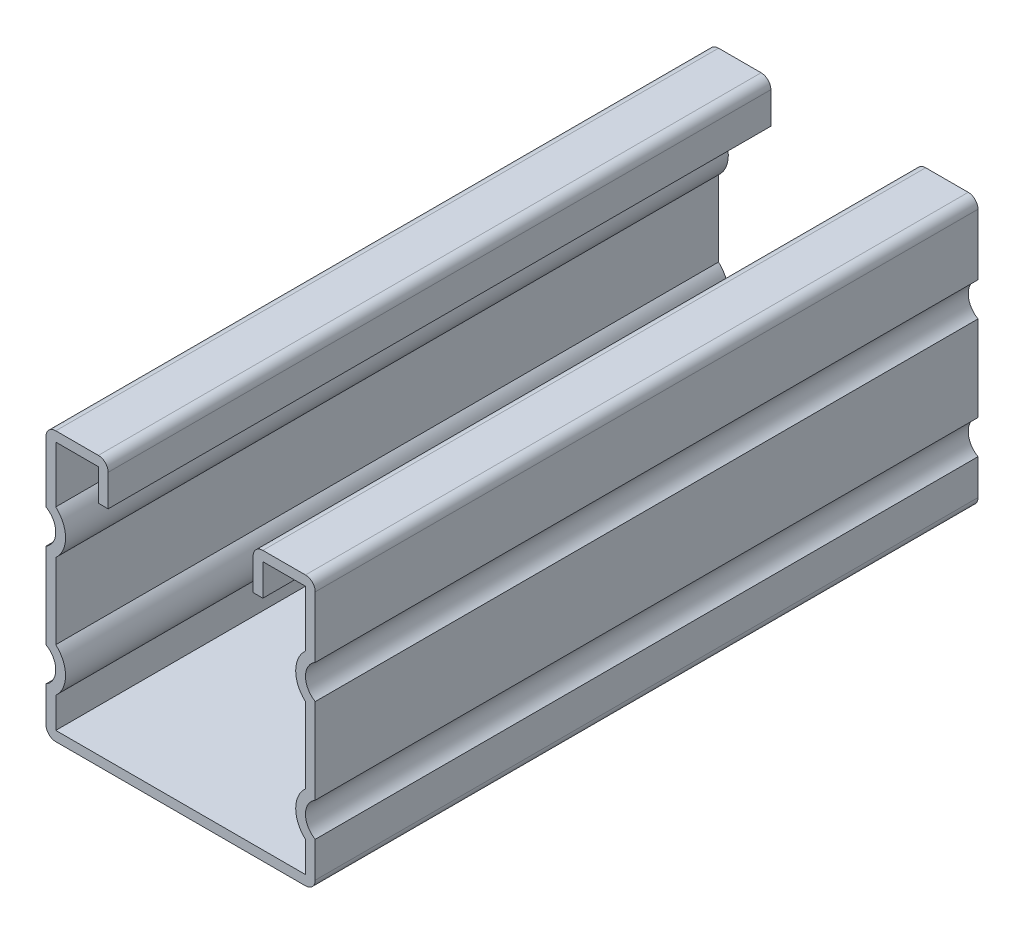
ISO-10303-21;
HEADER;
FILE_DESCRIPTION(('STEP AP214'),'2;1');
FILE_NAME('part.step','',(''),(''),'','','');
FILE_SCHEMA(('AUTOMOTIVE_DESIGN { 1 0 10303 214 1 1 1 1 }'));
ENDSEC;
DATA;
#1=APPLICATION_CONTEXT('core data for automotive mechanical design processes');
#2=APPLICATION_PROTOCOL_DEFINITION('international standard','automotive_design',2000,#1);
#3=PRODUCT_CONTEXT('',#1,'mechanical');
#4=PRODUCT('Part','Part','',(#3));
#5=PRODUCT_RELATED_PRODUCT_CATEGORY('part','',(#4));
#6=PRODUCT_DEFINITION_FORMATION('','',#4);
#7=PRODUCT_DEFINITION_CONTEXT('part definition',#1,'design');
#8=PRODUCT_DEFINITION('design','',#6,#7);
#9=PRODUCT_DEFINITION_SHAPE('','',#8);
#10=(LENGTH_UNIT() NAMED_UNIT(*) SI_UNIT(.MILLI.,.METRE.));
#11=(NAMED_UNIT(*) PLANE_ANGLE_UNIT() SI_UNIT($,.RADIAN.));
#12=(NAMED_UNIT(*) SI_UNIT($,.STERADIAN.) SOLID_ANGLE_UNIT());
#13=UNCERTAINTY_MEASURE_WITH_UNIT(LENGTH_MEASURE(1.E-05),#10,'distance_accuracy_value','');
#14=(GEOMETRIC_REPRESENTATION_CONTEXT(3) GLOBAL_UNCERTAINTY_ASSIGNED_CONTEXT((#13)) GLOBAL_UNIT_ASSIGNED_CONTEXT((#10,
#11,#12)) REPRESENTATION_CONTEXT('',''));
#15=CARTESIAN_POINT('',(0.,0.,0.));
#16=DIRECTION('',(0.,0.,1.));
#17=DIRECTION('',(1.,0.,0.));
#18=AXIS2_PLACEMENT_3D('',#15,#16,#17);
#19=CARTESIAN_POINT('',(-19.1389,21.1074,101.6));
#20=DIRECTION('',(-1.,0.,0.));
#21=DIRECTION('',(0.,-1.,0.));
#22=AXIS2_PLACEMENT_3D('',#19,#20,#21);
#23=PLANE('',#22);
#24=DIRECTION('',(0.,1.,0.));
#25=VECTOR('',#24,1.);
#26=CARTESIAN_POINT('',(-19.1389,21.1074,0.));
#27=LINE('',#26,#25);
#28=CARTESIAN_POINT('',(-19.1389,12.4949714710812,0.));
#29=VERTEX_POINT('',#28);
#30=CARTESIAN_POINT('',(-19.1389,21.1074,0.));
#31=VERTEX_POINT('',#30);
#32=EDGE_CURVE('E310',#29,#31,#27,.T.);
#33=ORIENTED_EDGE('',*,*,#32,.T.);
#34=DIRECTION('',(0.,0.,-1.));
#35=VECTOR('',#34,1.);
#36=CARTESIAN_POINT('',(-19.1389,21.1074,101.6));
#37=LINE('',#36,#35);
#38=CARTESIAN_POINT('',(-19.1389,21.1074,101.6));
#39=VERTEX_POINT('',#38);
#40=EDGE_CURVE('E11',#39,#31,#37,.T.);
#41=ORIENTED_EDGE('',*,*,#40,.F.);
#42=DIRECTION('',(0.,1.,0.));
#43=VECTOR('',#42,1.);
#44=CARTESIAN_POINT('',(-19.1389,21.1074,101.6));
#45=LINE('',#44,#43);
#46=CARTESIAN_POINT('',(-19.1389,12.4949714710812,101.6));
#47=VERTEX_POINT('',#46);
#48=EDGE_CURVE('E384',#47,#39,#45,.T.);
#49=ORIENTED_EDGE('',*,*,#48,.F.);
#50=DIRECTION('',(0.,0.,-1.));
#51=VECTOR('',#50,1.);
#52=CARTESIAN_POINT('',(-19.1389,12.4949714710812,101.6));
#53=LINE('',#52,#51);
#54=EDGE_CURVE('E306',#47,#29,#53,.T.);
#55=ORIENTED_EDGE('',*,*,#54,.T.);
#56=EDGE_LOOP('',(#33,#41,#49,#55));
#57=FACE_BOUND('',#56,.T.);
#58=ADVANCED_FACE('F33',(#57),#23,.F.);
#59=CARTESIAN_POINT('',(-19.1389,21.1074,101.6));
#60=DIRECTION('',(0.,1.,0.));
#61=DIRECTION('',(-1.,0.,0.));
#62=AXIS2_PLACEMENT_3D('',#59,#60,#61);
#63=PLANE('',#62);
#64=DIRECTION('',(1.,0.,0.));
#65=VECTOR('',#64,1.);
#66=CARTESIAN_POINT('',(-19.1389,21.1074,0.));
#67=LINE('',#66,#65);
#68=CARTESIAN_POINT('',(-12.6111,21.1074,0.));
#69=VERTEX_POINT('',#68);
#70=EDGE_CURVE('E313',#31,#69,#67,.T.);
#71=ORIENTED_EDGE('',*,*,#70,.T.);
#72=DIRECTION('',(0.,0.,-1.));
#73=VECTOR('',#72,1.);
#74=CARTESIAN_POINT('',(-12.6111,21.1074,101.6));
#75=LINE('',#74,#73);
#76=CARTESIAN_POINT('',(-12.6111,21.1074,101.6));
#77=VERTEX_POINT('',#76);
#78=EDGE_CURVE('E42',#77,#69,#75,.T.);
#79=ORIENTED_EDGE('',*,*,#78,.F.);
#80=DIRECTION('',(1.,0.,0.));
#81=VECTOR('',#80,1.);
#82=CARTESIAN_POINT('',(-19.1389,21.1074,101.6));
#83=LINE('',#82,#81);
#84=EDGE_CURVE('E183',#39,#77,#83,.T.);
#85=ORIENTED_EDGE('',*,*,#84,.F.);
#86=ORIENTED_EDGE('',*,*,#40,.T.);
#87=EDGE_LOOP('',(#71,#79,#85,#86));
#88=FACE_BOUND('',#87,.T.);
#89=ADVANCED_FACE('F593',(#88),#63,.F.);
#90=CARTESIAN_POINT('',(-12.6111,21.1074,101.6));
#91=DIRECTION('',(1.,0.,0.));
#92=DIRECTION('',(0.,0.,-1.));
#93=AXIS2_PLACEMENT_3D('',#90,#91,#92);
#94=PLANE('',#93);
#95=DIRECTION('',(0.,-1.,0.));
#96=VECTOR('',#95,1.);
#97=CARTESIAN_POINT('',(-12.6111,21.1074,0.));
#98=LINE('',#97,#96);
#99=CARTESIAN_POINT('',(-12.6111,16.256,0.));
#100=VERTEX_POINT('',#99);
#101=EDGE_CURVE('E315',#69,#100,#98,.T.);
#102=ORIENTED_EDGE('',*,*,#101,.T.);
#103=DIRECTION('',(0.,0.,-1.));
#104=VECTOR('',#103,1.);
#105=CARTESIAN_POINT('',(-12.6111,16.256,101.6));
#106=LINE('',#105,#104);
#107=CARTESIAN_POINT('',(-12.6111,16.256,101.6));
#108=VERTEX_POINT('',#107);
#109=EDGE_CURVE('E481',#108,#100,#106,.T.);
#110=ORIENTED_EDGE('',*,*,#109,.F.);
#111=DIRECTION('',(0.,-1.,0.));
#112=VECTOR('',#111,1.);
#113=CARTESIAN_POINT('',(-12.6111,21.1074,101.6));
#114=LINE('',#113,#112);
#115=EDGE_CURVE('E490',#77,#108,#114,.T.);
#116=ORIENTED_EDGE('',*,*,#115,.F.);
#117=ORIENTED_EDGE('',*,*,#78,.T.);
#118=EDGE_LOOP('',(#102,#110,#116,#117));
#119=FACE_BOUND('',#118,.T.);
#120=ADVANCED_FACE('F488',(#119),#94,.F.);
#121=CARTESIAN_POINT('',(-12.6111,16.256,101.6));
#122=DIRECTION('',(0.,1.,0.));
#123=DIRECTION('',(0.,0.,1.));
#124=AXIS2_PLACEMENT_3D('',#121,#122,#123);
#125=PLANE('',#124);
#126=DIRECTION('',(1.,0.,0.));
#127=VECTOR('',#126,1.);
#128=CARTESIAN_POINT('',(-12.6111,16.256,0.));
#129=LINE('',#128,#127);
#130=CARTESIAN_POINT('',(-11.1125,16.256,0.));
#131=VERTEX_POINT('',#130);
#132=EDGE_CURVE('E317',#100,#131,#129,.T.);
#133=ORIENTED_EDGE('',*,*,#132,.T.);
#134=DIRECTION('',(0.,0.,-1.));
#135=VECTOR('',#134,1.);
#136=CARTESIAN_POINT('',(-11.1125,16.256,101.6));
#137=LINE('',#136,#135);
#138=CARTESIAN_POINT('',(-11.1125,16.256,101.6));
#139=VERTEX_POINT('',#138);
#140=EDGE_CURVE('E478',#139,#131,#137,.T.);
#141=ORIENTED_EDGE('',*,*,#140,.F.);
#142=DIRECTION('',(1.,0.,0.));
#143=VECTOR('',#142,1.);
#144=CARTESIAN_POINT('',(-12.6111,16.256,101.6));
#145=LINE('',#144,#143);
#146=EDGE_CURVE('E508',#108,#139,#145,.T.);
#147=ORIENTED_EDGE('',*,*,#146,.F.);
#148=ORIENTED_EDGE('',*,*,#109,.T.);
#149=EDGE_LOOP('',(#133,#141,#147,#148));
#150=FACE_BOUND('',#149,.T.);
#151=ADVANCED_FACE('F499',(#150),#125,.F.);
#152=CARTESIAN_POINT('',(-11.1125,21.1074,101.6));
#153=DIRECTION('',(-1.,0.,0.));
#154=DIRECTION('',(0.,-1.,0.));
#155=AXIS2_PLACEMENT_3D('',#152,#153,#154);
#156=PLANE('',#155);
#157=DIRECTION('',(0.,1.,0.));
#158=VECTOR('',#157,1.);
#159=CARTESIAN_POINT('',(-11.1125,21.1074,0.));
#160=LINE('',#159,#158);
#161=CARTESIAN_POINT('',(-11.1125,21.1074,0.));
#162=VERTEX_POINT('',#161);
#163=EDGE_CURVE('E319',#131,#162,#160,.T.);
#164=ORIENTED_EDGE('',*,*,#163,.T.);
#165=DIRECTION('',(0.,0.,-1.));
#166=VECTOR('',#165,1.);
#167=CARTESIAN_POINT('',(-11.1125,21.1074,101.6));
#168=LINE('',#167,#166);
#169=CARTESIAN_POINT('',(-11.1125,21.1074,101.6));
#170=VERTEX_POINT('',#169);
#171=EDGE_CURVE('E475',#170,#162,#168,.T.);
#172=ORIENTED_EDGE('',*,*,#171,.F.);
#173=DIRECTION('',(0.,1.,0.));
#174=VECTOR('',#173,1.);
#175=CARTESIAN_POINT('',(-11.1125,21.1074,101.6));
#176=LINE('',#175,#174);
#177=EDGE_CURVE('E505',#139,#170,#176,.T.);
#178=ORIENTED_EDGE('',*,*,#177,.F.);
#179=ORIENTED_EDGE('',*,*,#140,.T.);
#180=EDGE_LOOP('',(#164,#172,#178,#179));
#181=FACE_BOUND('',#180,.T.);
#182=ADVANCED_FACE('F503',(#181),#156,.F.);
#183=CARTESIAN_POINT('',(-12.6111,21.1074,101.6));
#184=DIRECTION('',(0.,0.,-1.));
#185=DIRECTION('',(-1.,0.,0.));
#186=AXIS2_PLACEMENT_3D('',#183,#184,#185);
#187=CYLINDRICAL_SURFACE('',#186,1.4986);
#188=CARTESIAN_POINT('',(-12.6111,21.1074,0.));
#189=DIRECTION('',(0.,0.,1.));
#190=DIRECTION('',(-1.,0.,0.));
#191=AXIS2_PLACEMENT_3D('',#188,#189,#190);
#192=CIRCLE('',#191,1.4986);
#193=CARTESIAN_POINT('',(-12.6111,22.606,0.));
#194=VERTEX_POINT('',#193);
#195=EDGE_CURVE('E321',#162,#194,#192,.T.);
#196=ORIENTED_EDGE('',*,*,#195,.T.);
#197=DIRECTION('',(0.,0.,-1.));
#198=VECTOR('',#197,1.);
#199=CARTESIAN_POINT('',(-12.6111,22.606,101.6));
#200=LINE('',#199,#198);
#201=CARTESIAN_POINT('',(-12.6111,22.606,101.6));
#202=VERTEX_POINT('',#201);
#203=EDGE_CURVE('E472',#202,#194,#200,.T.);
#204=ORIENTED_EDGE('',*,*,#203,.F.);
#205=CARTESIAN_POINT('',(-12.6111,21.1074,101.6));
#206=DIRECTION('',(0.,0.,1.));
#207=DIRECTION('',(-1.,0.,0.));
#208=AXIS2_PLACEMENT_3D('',#205,#206,#207);
#209=CIRCLE('',#208,1.4986);
#210=EDGE_CURVE('E507',#170,#202,#209,.T.);
#211=ORIENTED_EDGE('',*,*,#210,.F.);
#212=ORIENTED_EDGE('',*,*,#171,.T.);
#213=EDGE_LOOP('',(#196,#204,#211,#212));
#214=FACE_BOUND('',#213,.T.);
#215=ADVANCED_FACE('F606',(#214),#187,.T.);
#216=CARTESIAN_POINT('',(-19.1389,22.606,101.6));
#217=DIRECTION('',(0.,-1.,0.));
#218=DIRECTION('',(1.,0.,0.));
#219=AXIS2_PLACEMENT_3D('',#216,#217,#218);
#220=PLANE('',#219);
#221=DIRECTION('',(-1.,0.,0.));
#222=VECTOR('',#221,1.);
#223=CARTESIAN_POINT('',(-19.1389,22.606,0.));
#224=LINE('',#223,#222);
#225=CARTESIAN_POINT('',(-19.1389,22.606,0.));
#226=VERTEX_POINT('',#225);
#227=EDGE_CURVE('E323',#194,#226,#224,.T.);
#228=ORIENTED_EDGE('',*,*,#227,.T.);
#229=DIRECTION('',(0.,0.,-1.));
#230=VECTOR('',#229,1.);
#231=CARTESIAN_POINT('',(-19.1389,22.606,101.6));
#232=LINE('',#231,#230);
#233=CARTESIAN_POINT('',(-19.1389,22.606,101.6));
#234=VERTEX_POINT('',#233);
#235=EDGE_CURVE('E469',#234,#226,#232,.T.);
#236=ORIENTED_EDGE('',*,*,#235,.F.);
#237=DIRECTION('',(-1.,0.,0.));
#238=VECTOR('',#237,1.);
#239=CARTESIAN_POINT('',(-19.1389,22.606,101.6));
#240=LINE('',#239,#238);
#241=EDGE_CURVE('E510',#202,#234,#240,.T.);
#242=ORIENTED_EDGE('',*,*,#241,.F.);
#243=ORIENTED_EDGE('',*,*,#203,.T.);
#244=EDGE_LOOP('',(#228,#236,#242,#243));
#245=FACE_BOUND('',#244,.T.);
#246=ADVANCED_FACE('F609',(#245),#220,.F.);
#247=CARTESIAN_POINT('',(-19.1389,21.1074,101.6));
#248=DIRECTION('',(0.,0.,-1.));
#249=DIRECTION('',(-1.,0.,0.));
#250=AXIS2_PLACEMENT_3D('',#247,#248,#249);
#251=CYLINDRICAL_SURFACE('',#250,1.49860000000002);
#252=CARTESIAN_POINT('',(-19.1389,21.1074,0.));
#253=DIRECTION('',(0.,0.,1.));
#254=DIRECTION('',(-1.,0.,0.));
#255=AXIS2_PLACEMENT_3D('',#252,#253,#254);
#256=CIRCLE('',#255,1.49860000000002);
#257=CARTESIAN_POINT('',(-20.6375,21.1074,0.));
#258=VERTEX_POINT('',#257);
#259=EDGE_CURVE('E325',#226,#258,#256,.T.);
#260=ORIENTED_EDGE('',*,*,#259,.T.);
#261=DIRECTION('',(0.,0.,-1.));
#262=VECTOR('',#261,1.);
#263=CARTESIAN_POINT('',(-20.6375,21.1074,101.6));
#264=LINE('',#263,#262);
#265=CARTESIAN_POINT('',(-20.6375,21.1074,101.6));
#266=VERTEX_POINT('',#265);
#267=EDGE_CURVE('E466',#266,#258,#264,.T.);
#268=ORIENTED_EDGE('',*,*,#267,.F.);
#269=CARTESIAN_POINT('',(-19.1389,21.1074,101.6));
#270=DIRECTION('',(0.,0.,1.));
#271=DIRECTION('',(-1.,0.,0.));
#272=AXIS2_PLACEMENT_3D('',#269,#270,#271);
#273=CIRCLE('',#272,1.49860000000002);
#274=EDGE_CURVE('E516',#234,#266,#273,.T.);
#275=ORIENTED_EDGE('',*,*,#274,.F.);
#276=ORIENTED_EDGE('',*,*,#235,.T.);
#277=EDGE_LOOP('',(#260,#268,#275,#276));
#278=FACE_BOUND('',#277,.T.);
#279=ADVANCED_FACE('F613',(#278),#251,.T.);
#280=CARTESIAN_POINT('',(-20.6375,21.1074,101.6));
#281=DIRECTION('',(1.,0.,0.));
#282=DIRECTION('',(0.,0.,-1.));
#283=AXIS2_PLACEMENT_3D('',#280,#281,#282);
#284=PLANE('',#283);
#285=DIRECTION('',(0.,-1.,0.));
#286=VECTOR('',#285,1.);
#287=CARTESIAN_POINT('',(-20.6375,21.1074,0.));
#288=LINE('',#287,#286);
#289=CARTESIAN_POINT('',(-20.6375,11.7396513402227,0.));
#290=VERTEX_POINT('',#289);
#291=EDGE_CURVE('E327',#258,#290,#288,.T.);
#292=ORIENTED_EDGE('',*,*,#291,.T.);
#293=DIRECTION('',(0.,0.,-1.));
#294=VECTOR('',#293,1.);
#295=CARTESIAN_POINT('',(-20.6375,11.7396513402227,101.6));
#296=LINE('',#295,#294);
#297=CARTESIAN_POINT('',(-20.6375,11.7396513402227,101.6));
#298=VERTEX_POINT('',#297);
#299=EDGE_CURVE('E463',#298,#290,#296,.T.);
#300=ORIENTED_EDGE('',*,*,#299,.F.);
#301=DIRECTION('',(0.,-1.,0.));
#302=VECTOR('',#301,1.);
#303=CARTESIAN_POINT('',(-20.6375,21.1074,101.6));
#304=LINE('',#303,#302);
#305=EDGE_CURVE('E518',#266,#298,#304,.T.);
#306=ORIENTED_EDGE('',*,*,#305,.F.);
#307=ORIENTED_EDGE('',*,*,#267,.T.);
#308=EDGE_LOOP('',(#292,#300,#306,#307));
#309=FACE_BOUND('',#308,.T.);
#310=ADVANCED_FACE('F617',(#309),#284,.F.);
#311=CARTESIAN_POINT('',(-22.1361,9.144,101.6));
#312=DIRECTION('',(0.,0.,-1.));
#313=DIRECTION('',(-1.,0.,0.));
#314=AXIS2_PLACEMENT_3D('',#311,#312,#313);
#315=CYLINDRICAL_SURFACE('',#314,2.9972);
#316=CARTESIAN_POINT('',(-22.1361,9.144,0.));
#317=DIRECTION('',(0.,0.,-1.));
#318=DIRECTION('',(1.,0.,0.));
#319=AXIS2_PLACEMENT_3D('',#316,#317,#318);
#320=CIRCLE('',#319,2.9972);
#321=CARTESIAN_POINT('',(-20.6375,6.54834865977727,0.));
#322=VERTEX_POINT('',#321);
#323=EDGE_CURVE('E329',#290,#322,#320,.T.);
#324=ORIENTED_EDGE('',*,*,#323,.T.);
#325=DIRECTION('',(0.,0.,-1.));
#326=VECTOR('',#325,1.);
#327=CARTESIAN_POINT('',(-20.6375,6.54834865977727,101.6));
#328=LINE('',#327,#326);
#329=CARTESIAN_POINT('',(-20.6375,6.54834865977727,101.6));
#330=VERTEX_POINT('',#329);
#331=EDGE_CURVE('E460',#330,#322,#328,.T.);
#332=ORIENTED_EDGE('',*,*,#331,.F.);
#333=CARTESIAN_POINT('',(-22.1361,9.144,101.6));
#334=DIRECTION('',(0.,0.,-1.));
#335=DIRECTION('',(1.,0.,0.));
#336=AXIS2_PLACEMENT_3D('',#333,#334,#335);
#337=CIRCLE('',#336,2.9972);
#338=EDGE_CURVE('E520',#298,#330,#337,.T.);
#339=ORIENTED_EDGE('',*,*,#338,.F.);
#340=ORIENTED_EDGE('',*,*,#299,.T.);
#341=EDGE_LOOP('',(#324,#332,#339,#340));
#342=FACE_BOUND('',#341,.T.);
#343=ADVANCED_FACE('F621',(#342),#315,.F.);
#344=CARTESIAN_POINT('',(-20.6375,6.54834865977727,101.6));
#345=DIRECTION('',(1.,0.,0.));
#346=DIRECTION('',(0.,0.,-1.));
#347=AXIS2_PLACEMENT_3D('',#344,#345,#346);
#348=PLANE('',#347);
#349=DIRECTION('',(0.,-1.,0.));
#350=VECTOR('',#349,1.);
#351=CARTESIAN_POINT('',(-20.6375,6.54834865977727,0.));
#352=LINE('',#351,#350);
#353=CARTESIAN_POINT('',(-20.6375,-6.54834865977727,0.));
#354=VERTEX_POINT('',#353);
#355=EDGE_CURVE('E331',#322,#354,#352,.T.);
#356=ORIENTED_EDGE('',*,*,#355,.T.);
#357=DIRECTION('',(0.,0.,-1.));
#358=VECTOR('',#357,1.);
#359=CARTESIAN_POINT('',(-20.6375,-6.54834865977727,101.6));
#360=LINE('',#359,#358);
#361=CARTESIAN_POINT('',(-20.6375,-6.54834865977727,101.6));
#362=VERTEX_POINT('',#361);
#363=EDGE_CURVE('E457',#362,#354,#360,.T.);
#364=ORIENTED_EDGE('',*,*,#363,.F.);
#365=DIRECTION('',(0.,-1.,0.));
#366=VECTOR('',#365,1.);
#367=CARTESIAN_POINT('',(-20.6375,6.54834865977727,101.6));
#368=LINE('',#367,#366);
#369=EDGE_CURVE('E522',#330,#362,#368,.T.);
#370=ORIENTED_EDGE('',*,*,#369,.F.);
#371=ORIENTED_EDGE('',*,*,#331,.T.);
#372=EDGE_LOOP('',(#356,#364,#370,#371));
#373=FACE_BOUND('',#372,.T.);
#374=ADVANCED_FACE('F625',(#373),#348,.F.);
#375=CARTESIAN_POINT('',(-22.1361,-9.144,101.6));
#376=DIRECTION('',(0.,0.,-1.));
#377=DIRECTION('',(-1.,0.,0.));
#378=AXIS2_PLACEMENT_3D('',#375,#376,#377);
#379=CYLINDRICAL_SURFACE('',#378,2.9972);
#380=CARTESIAN_POINT('',(-22.1361,-9.144,0.));
#381=DIRECTION('',(0.,0.,-1.));
#382=DIRECTION('',(-1.,0.,0.));
#383=AXIS2_PLACEMENT_3D('',#380,#381,#382);
#384=CIRCLE('',#383,2.9972);
#385=CARTESIAN_POINT('',(-20.6375,-11.7396513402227,0.));
#386=VERTEX_POINT('',#385);
#387=EDGE_CURVE('E333',#354,#386,#384,.T.);
#388=ORIENTED_EDGE('',*,*,#387,.T.);
#389=DIRECTION('',(0.,0.,-1.));
#390=VECTOR('',#389,1.);
#391=CARTESIAN_POINT('',(-20.6375,-11.7396513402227,101.6));
#392=LINE('',#391,#390);
#393=CARTESIAN_POINT('',(-20.6375,-11.7396513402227,101.6));
#394=VERTEX_POINT('',#393);
#395=EDGE_CURVE('E454',#394,#386,#392,.T.);
#396=ORIENTED_EDGE('',*,*,#395,.F.);
#397=CARTESIAN_POINT('',(-22.1361,-9.144,101.6));
#398=DIRECTION('',(0.,0.,-1.));
#399=DIRECTION('',(-1.,0.,0.));
#400=AXIS2_PLACEMENT_3D('',#397,#398,#399);
#401=CIRCLE('',#400,2.9972);
#402=EDGE_CURVE('E524',#362,#394,#401,.T.);
#403=ORIENTED_EDGE('',*,*,#402,.F.);
#404=ORIENTED_EDGE('',*,*,#363,.T.);
#405=EDGE_LOOP('',(#388,#396,#403,#404));
#406=FACE_BOUND('',#405,.T.);
#407=ADVANCED_FACE('F629',(#406),#379,.F.);
#408=CARTESIAN_POINT('',(-20.6375,-11.7396513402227,101.6));
#409=DIRECTION('',(1.,0.,0.));
#410=DIRECTION('',(0.,1.,0.));
#411=AXIS2_PLACEMENT_3D('',#408,#409,#410);
#412=PLANE('',#411);
#413=DIRECTION('',(0.,-1.,0.));
#414=VECTOR('',#413,1.);
#415=CARTESIAN_POINT('',(-20.6375,-11.7396513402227,0.));
#416=LINE('',#415,#414);
#417=CARTESIAN_POINT('',(-20.6375,-17.1704,0.));
#418=VERTEX_POINT('',#417);
#419=EDGE_CURVE('E335',#386,#418,#416,.T.);
#420=ORIENTED_EDGE('',*,*,#419,.T.);
#421=DIRECTION('',(0.,0.,-1.));
#422=VECTOR('',#421,1.);
#423=CARTESIAN_POINT('',(-20.6375,-17.1704,101.6));
#424=LINE('',#423,#422);
#425=CARTESIAN_POINT('',(-20.6375,-17.1704,101.6));
#426=VERTEX_POINT('',#425);
#427=EDGE_CURVE('E451',#426,#418,#424,.T.);
#428=ORIENTED_EDGE('',*,*,#427,.F.);
#429=DIRECTION('',(0.,-1.,0.));
#430=VECTOR('',#429,1.);
#431=CARTESIAN_POINT('',(-20.6375,-11.7396513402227,101.6));
#432=LINE('',#431,#430);
#433=EDGE_CURVE('E526',#394,#426,#432,.T.);
#434=ORIENTED_EDGE('',*,*,#433,.F.);
#435=ORIENTED_EDGE('',*,*,#395,.T.);
#436=EDGE_LOOP('',(#420,#428,#434,#435));
#437=FACE_BOUND('',#436,.T.);
#438=ADVANCED_FACE('F633',(#437),#412,.F.);
#439=CARTESIAN_POINT('',(-19.1389,-17.1704,101.6));
#440=DIRECTION('',(0.,0.,-1.));
#441=DIRECTION('',(-1.,0.,0.));
#442=AXIS2_PLACEMENT_3D('',#439,#440,#441);
#443=CYLINDRICAL_SURFACE('',#442,1.4986);
#444=CARTESIAN_POINT('',(-19.1389,-17.1704,0.));
#445=DIRECTION('',(0.,0.,1.));
#446=DIRECTION('',(-1.,0.,0.));
#447=AXIS2_PLACEMENT_3D('',#444,#445,#446);
#448=CIRCLE('',#447,1.4986);
#449=CARTESIAN_POINT('',(-19.1389,-18.669,0.));
#450=VERTEX_POINT('',#449);
#451=EDGE_CURVE('E337',#418,#450,#448,.T.);
#452=ORIENTED_EDGE('',*,*,#451,.T.);
#453=DIRECTION('',(0.,0.,-1.));
#454=VECTOR('',#453,1.);
#455=CARTESIAN_POINT('',(-19.1389,-18.669,101.6));
#456=LINE('',#455,#454);
#457=CARTESIAN_POINT('',(-19.1389,-18.669,101.6));
#458=VERTEX_POINT('',#457);
#459=EDGE_CURVE('E448',#458,#450,#456,.T.);
#460=ORIENTED_EDGE('',*,*,#459,.F.);
#461=CARTESIAN_POINT('',(-19.1389,-17.1704,101.6));
#462=DIRECTION('',(0.,0.,1.));
#463=DIRECTION('',(-1.,0.,0.));
#464=AXIS2_PLACEMENT_3D('',#461,#462,#463);
#465=CIRCLE('',#464,1.4986);
#466=EDGE_CURVE('E528',#426,#458,#465,.T.);
#467=ORIENTED_EDGE('',*,*,#466,.F.);
#468=ORIENTED_EDGE('',*,*,#427,.T.);
#469=EDGE_LOOP('',(#452,#460,#467,#468));
#470=FACE_BOUND('',#469,.T.);
#471=ADVANCED_FACE('F637',(#470),#443,.T.);
#472=CARTESIAN_POINT('',(-19.1389,-18.669,101.6));
#473=DIRECTION('',(0.,1.,0.));
#474=DIRECTION('',(0.,0.,1.));
#475=AXIS2_PLACEMENT_3D('',#472,#473,#474);
#476=PLANE('',#475);
#477=CARTESIAN_POINT('',(0.,-18.669,71.4375));
#478=DIRECTION('',(0.,-1.,0.));
#479=DIRECTION('',(0.,0.,-1.));
#480=AXIS2_PLACEMENT_3D('',#477,#478,#479);
#481=CIRCLE('',#480,7.14375);
#482=CARTESIAN_POINT('',(0.,-18.669,64.29375));
#483=VERTEX_POINT('',#482);
#484=EDGE_CURVE('E792',#483,#483,#481,.T.);
#485=ORIENTED_EDGE('',*,*,#484,.F.);
#486=EDGE_LOOP('',(#485));
#487=FACE_BOUND('',#486,.T.);
#488=CARTESIAN_POINT('',(0.,-18.669,23.8125));
#489=DIRECTION('',(0.,-1.,0.));
#490=DIRECTION('',(0.,0.,-1.));
#491=AXIS2_PLACEMENT_3D('',#488,#489,#490);
#492=CIRCLE('',#491,7.14375);
#493=CARTESIAN_POINT('',(0.,-18.669,16.66875));
#494=VERTEX_POINT('',#493);
#495=EDGE_CURVE('E796',#494,#494,#492,.T.);
#496=ORIENTED_EDGE('',*,*,#495,.F.);
#497=EDGE_LOOP('',(#496));
#498=FACE_BOUND('',#497,.T.);
#499=DIRECTION('',(1.,0.,0.));
#500=VECTOR('',#499,1.);
#501=CARTESIAN_POINT('',(-19.1389,-18.669,0.));
#502=LINE('',#501,#500);
#503=CARTESIAN_POINT('',(19.1389,-18.669,0.));
#504=VERTEX_POINT('',#503);
#505=EDGE_CURVE('E339',#450,#504,#502,.T.);
#506=ORIENTED_EDGE('',*,*,#505,.T.);
#507=DIRECTION('',(0.,0.,-1.));
#508=VECTOR('',#507,1.);
#509=CARTESIAN_POINT('',(19.1389,-18.669,101.6));
#510=LINE('',#509,#508);
#511=CARTESIAN_POINT('',(19.1389,-18.669,101.6));
#512=VERTEX_POINT('',#511);
#513=EDGE_CURVE('E445',#512,#504,#510,.T.);
#514=ORIENTED_EDGE('',*,*,#513,.F.);
#515=DIRECTION('',(1.,0.,0.));
#516=VECTOR('',#515,1.);
#517=CARTESIAN_POINT('',(-19.1389,-18.669,101.6));
#518=LINE('',#517,#516);
#519=EDGE_CURVE('E530',#458,#512,#518,.T.);
#520=ORIENTED_EDGE('',*,*,#519,.F.);
#521=ORIENTED_EDGE('',*,*,#459,.T.);
#522=EDGE_LOOP('',(#506,#514,#520,#521));
#523=FACE_BOUND('',#522,.T.);
#524=ADVANCED_FACE('F641',(#487,#498,#523),#476,.F.);
#525=CARTESIAN_POINT('',(19.1389,-17.1704,101.6));
#526=DIRECTION('',(0.,0.,-1.));
#527=DIRECTION('',(-1.,0.,0.));
#528=AXIS2_PLACEMENT_3D('',#525,#526,#527);
#529=CYLINDRICAL_SURFACE('',#528,1.4986);
#530=CARTESIAN_POINT('',(19.1389,-17.1704,0.));
#531=DIRECTION('',(0.,0.,1.));
#532=DIRECTION('',(-1.,0.,0.));
#533=AXIS2_PLACEMENT_3D('',#530,#531,#532);
#534=CIRCLE('',#533,1.4986);
#535=CARTESIAN_POINT('',(20.6375,-17.1704,0.));
#536=VERTEX_POINT('',#535);
#537=EDGE_CURVE('E341',#504,#536,#534,.T.);
#538=ORIENTED_EDGE('',*,*,#537,.T.);
#539=DIRECTION('',(0.,0.,-1.));
#540=VECTOR('',#539,1.);
#541=CARTESIAN_POINT('',(20.6375,-17.1704,101.6));
#542=LINE('',#541,#540);
#543=CARTESIAN_POINT('',(20.6375,-17.1704,101.6));
#544=VERTEX_POINT('',#543);
#545=EDGE_CURVE('E442',#544,#536,#542,.T.);
#546=ORIENTED_EDGE('',*,*,#545,.F.);
#547=CARTESIAN_POINT('',(19.1389,-17.1704,101.6));
#548=DIRECTION('',(0.,0.,1.));
#549=DIRECTION('',(-1.,0.,0.));
#550=AXIS2_PLACEMENT_3D('',#547,#548,#549);
#551=CIRCLE('',#550,1.4986);
#552=EDGE_CURVE('E532',#512,#544,#551,.T.);
#553=ORIENTED_EDGE('',*,*,#552,.F.);
#554=ORIENTED_EDGE('',*,*,#513,.T.);
#555=EDGE_LOOP('',(#538,#546,#553,#554));
#556=FACE_BOUND('',#555,.T.);
#557=ADVANCED_FACE('F645',(#556),#529,.T.);
#558=CARTESIAN_POINT('',(20.6375,-17.1704,101.6));
#559=DIRECTION('',(-1.,0.,0.));
#560=DIRECTION('',(0.,-1.,0.));
#561=AXIS2_PLACEMENT_3D('',#558,#559,#560);
#562=PLANE('',#561);
#563=DIRECTION('',(0.,1.,0.));
#564=VECTOR('',#563,1.);
#565=CARTESIAN_POINT('',(20.6375,-17.1704,0.));
#566=LINE('',#565,#564);
#567=CARTESIAN_POINT('',(20.6375,-11.7396513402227,0.));
#568=VERTEX_POINT('',#567);
#569=EDGE_CURVE('E343',#536,#568,#566,.T.);
#570=ORIENTED_EDGE('',*,*,#569,.T.);
#571=DIRECTION('',(0.,0.,-1.));
#572=VECTOR('',#571,1.);
#573=CARTESIAN_POINT('',(20.6375,-11.7396513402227,101.6));
#574=LINE('',#573,#572);
#575=CARTESIAN_POINT('',(20.6375,-11.7396513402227,101.6));
#576=VERTEX_POINT('',#575);
#577=EDGE_CURVE('E439',#576,#568,#574,.T.);
#578=ORIENTED_EDGE('',*,*,#577,.F.);
#579=DIRECTION('',(0.,1.,0.));
#580=VECTOR('',#579,1.);
#581=CARTESIAN_POINT('',(20.6375,-17.1704,101.6));
#582=LINE('',#581,#580);
#583=EDGE_CURVE('E534',#544,#576,#582,.T.);
#584=ORIENTED_EDGE('',*,*,#583,.F.);
#585=ORIENTED_EDGE('',*,*,#545,.T.);
#586=EDGE_LOOP('',(#570,#578,#584,#585));
#587=FACE_BOUND('',#586,.T.);
#588=ADVANCED_FACE('F649',(#587),#562,.F.);
#589=CARTESIAN_POINT('',(22.1361,-9.144,101.6));
#590=DIRECTION('',(0.,0.,-1.));
#591=DIRECTION('',(-1.,0.,0.));
#592=AXIS2_PLACEMENT_3D('',#589,#590,#591);
#593=CYLINDRICAL_SURFACE('',#592,2.9972);
#594=CARTESIAN_POINT('',(22.1361,-9.144,0.));
#595=DIRECTION('',(0.,0.,-1.));
#596=DIRECTION('',(-1.,0.,0.));
#597=AXIS2_PLACEMENT_3D('',#594,#595,#596);
#598=CIRCLE('',#597,2.9972);
#599=CARTESIAN_POINT('',(20.6375,-6.54834865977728,0.));
#600=VERTEX_POINT('',#599);
#601=EDGE_CURVE('E345',#568,#600,#598,.T.);
#602=ORIENTED_EDGE('',*,*,#601,.T.);
#603=DIRECTION('',(0.,0.,-1.));
#604=VECTOR('',#603,1.);
#605=CARTESIAN_POINT('',(20.6375,-6.54834865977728,101.6));
#606=LINE('',#605,#604);
#607=CARTESIAN_POINT('',(20.6375,-6.54834865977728,101.6));
#608=VERTEX_POINT('',#607);
#609=EDGE_CURVE('E436',#608,#600,#606,.T.);
#610=ORIENTED_EDGE('',*,*,#609,.F.);
#611=CARTESIAN_POINT('',(22.1361,-9.144,101.6));
#612=DIRECTION('',(0.,0.,-1.));
#613=DIRECTION('',(-1.,0.,0.));
#614=AXIS2_PLACEMENT_3D('',#611,#612,#613);
#615=CIRCLE('',#614,2.9972);
#616=EDGE_CURVE('E536',#576,#608,#615,.T.);
#617=ORIENTED_EDGE('',*,*,#616,.F.);
#618=ORIENTED_EDGE('',*,*,#577,.T.);
#619=EDGE_LOOP('',(#602,#610,#617,#618));
#620=FACE_BOUND('',#619,.T.);
#621=ADVANCED_FACE('F653',(#620),#593,.F.);
#622=CARTESIAN_POINT('',(20.6375,-6.54834865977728,101.6));
#623=DIRECTION('',(-1.,0.,0.));
#624=DIRECTION('',(0.,0.,1.));
#625=AXIS2_PLACEMENT_3D('',#622,#623,#624);
#626=PLANE('',#625);
#627=DIRECTION('',(0.,1.,0.));
#628=VECTOR('',#627,1.);
#629=CARTESIAN_POINT('',(20.6375,-6.54834865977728,0.));
#630=LINE('',#629,#628);
#631=CARTESIAN_POINT('',(20.6375,6.54834865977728,0.));
#632=VERTEX_POINT('',#631);
#633=EDGE_CURVE('E347',#600,#632,#630,.T.);
#634=ORIENTED_EDGE('',*,*,#633,.T.);
#635=DIRECTION('',(0.,0.,-1.));
#636=VECTOR('',#635,1.);
#637=CARTESIAN_POINT('',(20.6375,6.54834865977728,101.6));
#638=LINE('',#637,#636);
#639=CARTESIAN_POINT('',(20.6375,6.54834865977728,101.6));
#640=VERTEX_POINT('',#639);
#641=EDGE_CURVE('E433',#640,#632,#638,.T.);
#642=ORIENTED_EDGE('',*,*,#641,.F.);
#643=DIRECTION('',(0.,1.,0.));
#644=VECTOR('',#643,1.);
#645=CARTESIAN_POINT('',(20.6375,-6.54834865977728,101.6));
#646=LINE('',#645,#644);
#647=EDGE_CURVE('E538',#608,#640,#646,.T.);
#648=ORIENTED_EDGE('',*,*,#647,.F.);
#649=ORIENTED_EDGE('',*,*,#609,.T.);
#650=EDGE_LOOP('',(#634,#642,#648,#649));
#651=FACE_BOUND('',#650,.T.);
#652=ADVANCED_FACE('F657',(#651),#626,.F.);
#653=CARTESIAN_POINT('',(22.1361,9.144,101.6));
#654=DIRECTION('',(0.,0.,-1.));
#655=DIRECTION('',(-1.,0.,0.));
#656=AXIS2_PLACEMENT_3D('',#653,#654,#655);
#657=CYLINDRICAL_SURFACE('',#656,2.9972);
#658=CARTESIAN_POINT('',(22.1361,9.144,0.));
#659=DIRECTION('',(0.,0.,-1.));
#660=DIRECTION('',(1.,0.,0.));
#661=AXIS2_PLACEMENT_3D('',#658,#659,#660);
#662=CIRCLE('',#661,2.9972);
#663=CARTESIAN_POINT('',(20.6375,11.7396513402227,0.));
#664=VERTEX_POINT('',#663);
#665=EDGE_CURVE('E349',#632,#664,#662,.T.);
#666=ORIENTED_EDGE('',*,*,#665,.T.);
#667=DIRECTION('',(0.,0.,-1.));
#668=VECTOR('',#667,1.);
#669=CARTESIAN_POINT('',(20.6375,11.7396513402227,101.6));
#670=LINE('',#669,#668);
#671=CARTESIAN_POINT('',(20.6375,11.7396513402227,101.6));
#672=VERTEX_POINT('',#671);
#673=EDGE_CURVE('E430',#672,#664,#670,.T.);
#674=ORIENTED_EDGE('',*,*,#673,.F.);
#675=CARTESIAN_POINT('',(22.1361,9.144,101.6));
#676=DIRECTION('',(0.,0.,-1.));
#677=DIRECTION('',(1.,0.,0.));
#678=AXIS2_PLACEMENT_3D('',#675,#676,#677);
#679=CIRCLE('',#678,2.9972);
#680=EDGE_CURVE('E540',#640,#672,#679,.T.);
#681=ORIENTED_EDGE('',*,*,#680,.F.);
#682=ORIENTED_EDGE('',*,*,#641,.T.);
#683=EDGE_LOOP('',(#666,#674,#681,#682));
#684=FACE_BOUND('',#683,.T.);
#685=ADVANCED_FACE('F661',(#684),#657,.F.);
#686=CARTESIAN_POINT('',(20.6375,11.7396513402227,101.6));
#687=DIRECTION('',(-1.,0.,0.));
#688=DIRECTION('',(0.,-1.,0.));
#689=AXIS2_PLACEMENT_3D('',#686,#687,#688);
#690=PLANE('',#689);
#691=DIRECTION('',(0.,1.,0.));
#692=VECTOR('',#691,1.);
#693=CARTESIAN_POINT('',(20.6375,11.7396513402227,0.));
#694=LINE('',#693,#692);
#695=CARTESIAN_POINT('',(20.6375,21.1074,0.));
#696=VERTEX_POINT('',#695);
#697=EDGE_CURVE('E351',#664,#696,#694,.T.);
#698=ORIENTED_EDGE('',*,*,#697,.T.);
#699=DIRECTION('',(0.,0.,-1.));
#700=VECTOR('',#699,1.);
#701=CARTESIAN_POINT('',(20.6375,21.1074,101.6));
#702=LINE('',#701,#700);
#703=CARTESIAN_POINT('',(20.6375,21.1074,101.6));
#704=VERTEX_POINT('',#703);
#705=EDGE_CURVE('E427',#704,#696,#702,.T.);
#706=ORIENTED_EDGE('',*,*,#705,.F.);
#707=DIRECTION('',(0.,1.,0.));
#708=VECTOR('',#707,1.);
#709=CARTESIAN_POINT('',(20.6375,11.7396513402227,101.6));
#710=LINE('',#709,#708);
#711=EDGE_CURVE('E542',#672,#704,#710,.T.);
#712=ORIENTED_EDGE('',*,*,#711,.F.);
#713=ORIENTED_EDGE('',*,*,#673,.T.);
#714=EDGE_LOOP('',(#698,#706,#712,#713));
#715=FACE_BOUND('',#714,.T.);
#716=ADVANCED_FACE('F665',(#715),#690,.F.);
#717=CARTESIAN_POINT('',(19.1389,21.1074,101.6));
#718=DIRECTION('',(0.,0.,-1.));
#719=DIRECTION('',(-1.,0.,0.));
#720=AXIS2_PLACEMENT_3D('',#717,#718,#719);
#721=CYLINDRICAL_SURFACE('',#720,1.4986);
#722=CARTESIAN_POINT('',(19.1389,21.1074,0.));
#723=DIRECTION('',(0.,0.,1.));
#724=DIRECTION('',(-1.,0.,0.));
#725=AXIS2_PLACEMENT_3D('',#722,#723,#724);
#726=CIRCLE('',#725,1.4986);
#727=CARTESIAN_POINT('',(19.1389,22.606,0.));
#728=VERTEX_POINT('',#727);
#729=EDGE_CURVE('E353',#696,#728,#726,.T.);
#730=ORIENTED_EDGE('',*,*,#729,.T.);
#731=DIRECTION('',(0.,0.,-1.));
#732=VECTOR('',#731,1.);
#733=CARTESIAN_POINT('',(19.1389,22.606,101.6));
#734=LINE('',#733,#732);
#735=CARTESIAN_POINT('',(19.1389,22.606,101.6));
#736=VERTEX_POINT('',#735);
#737=EDGE_CURVE('E424',#736,#728,#734,.T.);
#738=ORIENTED_EDGE('',*,*,#737,.F.);
#739=CARTESIAN_POINT('',(19.1389,21.1074,101.6));
#740=DIRECTION('',(0.,0.,1.));
#741=DIRECTION('',(-1.,0.,0.));
#742=AXIS2_PLACEMENT_3D('',#739,#740,#741);
#743=CIRCLE('',#742,1.4986);
#744=EDGE_CURVE('E544',#704,#736,#743,.T.);
#745=ORIENTED_EDGE('',*,*,#744,.F.);
#746=ORIENTED_EDGE('',*,*,#705,.T.);
#747=EDGE_LOOP('',(#730,#738,#745,#746));
#748=FACE_BOUND('',#747,.T.);
#749=ADVANCED_FACE('F669',(#748),#721,.T.);
#750=CARTESIAN_POINT('',(19.1389,22.606,101.6));
#751=DIRECTION('',(0.,-1.,0.));
#752=DIRECTION('',(0.,0.,-1.));
#753=AXIS2_PLACEMENT_3D('',#750,#751,#752);
#754=PLANE('',#753);
#755=DIRECTION('',(-1.,0.,0.));
#756=VECTOR('',#755,1.);
#757=CARTESIAN_POINT('',(19.1389,22.606,0.));
#758=LINE('',#757,#756);
#759=CARTESIAN_POINT('',(12.6111,22.606,0.));
#760=VERTEX_POINT('',#759);
#761=EDGE_CURVE('E355',#728,#760,#758,.T.);
#762=ORIENTED_EDGE('',*,*,#761,.T.);
#763=DIRECTION('',(0.,0.,-1.));
#764=VECTOR('',#763,1.);
#765=CARTESIAN_POINT('',(12.6111,22.606,101.6));
#766=LINE('',#765,#764);
#767=CARTESIAN_POINT('',(12.6111,22.606,101.6));
#768=VERTEX_POINT('',#767);
#769=EDGE_CURVE('E421',#768,#760,#766,.T.);
#770=ORIENTED_EDGE('',*,*,#769,.F.);
#771=DIRECTION('',(-1.,0.,0.));
#772=VECTOR('',#771,1.);
#773=CARTESIAN_POINT('',(19.1389,22.606,101.6));
#774=LINE('',#773,#772);
#775=EDGE_CURVE('E546',#736,#768,#774,.T.);
#776=ORIENTED_EDGE('',*,*,#775,.F.);
#777=ORIENTED_EDGE('',*,*,#737,.T.);
#778=EDGE_LOOP('',(#762,#770,#776,#777));
#779=FACE_BOUND('',#778,.T.);
#780=ADVANCED_FACE('F673',(#779),#754,.F.);
#781=CARTESIAN_POINT('',(12.6111,21.1074,101.6));
#782=DIRECTION('',(0.,0.,-1.));
#783=DIRECTION('',(-1.,0.,0.));
#784=AXIS2_PLACEMENT_3D('',#781,#782,#783);
#785=CYLINDRICAL_SURFACE('',#784,1.4986);
#786=CARTESIAN_POINT('',(12.6111,21.1074,0.));
#787=DIRECTION('',(0.,0.,1.));
#788=DIRECTION('',(-1.,0.,0.));
#789=AXIS2_PLACEMENT_3D('',#786,#787,#788);
#790=CIRCLE('',#789,1.4986);
#791=CARTESIAN_POINT('',(11.1125,21.1074,0.));
#792=VERTEX_POINT('',#791);
#793=EDGE_CURVE('E357',#760,#792,#790,.T.);
#794=ORIENTED_EDGE('',*,*,#793,.T.);
#795=DIRECTION('',(0.,0.,-1.));
#796=VECTOR('',#795,1.);
#797=CARTESIAN_POINT('',(11.1125,21.1074,101.6));
#798=LINE('',#797,#796);
#799=CARTESIAN_POINT('',(11.1125,21.1074,101.6));
#800=VERTEX_POINT('',#799);
#801=EDGE_CURVE('E418',#800,#792,#798,.T.);
#802=ORIENTED_EDGE('',*,*,#801,.F.);
#803=CARTESIAN_POINT('',(12.6111,21.1074,101.6));
#804=DIRECTION('',(0.,0.,1.));
#805=DIRECTION('',(-1.,0.,0.));
#806=AXIS2_PLACEMENT_3D('',#803,#804,#805);
#807=CIRCLE('',#806,1.4986);
#808=EDGE_CURVE('E548',#768,#800,#807,.T.);
#809=ORIENTED_EDGE('',*,*,#808,.F.);
#810=ORIENTED_EDGE('',*,*,#769,.T.);
#811=EDGE_LOOP('',(#794,#802,#809,#810));
#812=FACE_BOUND('',#811,.T.);
#813=ADVANCED_FACE('F677',(#812),#785,.T.);
#814=CARTESIAN_POINT('',(11.1125,21.1074,101.6));
#815=DIRECTION('',(1.,0.,0.));
#816=DIRECTION('',(0.,0.,-1.));
#817=AXIS2_PLACEMENT_3D('',#814,#815,#816);
#818=PLANE('',#817);
#819=DIRECTION('',(0.,-1.,0.));
#820=VECTOR('',#819,1.);
#821=CARTESIAN_POINT('',(11.1125,21.1074,0.));
#822=LINE('',#821,#820);
#823=CARTESIAN_POINT('',(11.1125,16.256,0.));
#824=VERTEX_POINT('',#823);
#825=EDGE_CURVE('E359',#792,#824,#822,.T.);
#826=ORIENTED_EDGE('',*,*,#825,.T.);
#827=DIRECTION('',(0.,0.,-1.));
#828=VECTOR('',#827,1.);
#829=CARTESIAN_POINT('',(11.1125,16.256,101.6));
#830=LINE('',#829,#828);
#831=CARTESIAN_POINT('',(11.1125,16.256,101.6));
#832=VERTEX_POINT('',#831);
#833=EDGE_CURVE('E415',#832,#824,#830,.T.);
#834=ORIENTED_EDGE('',*,*,#833,.F.);
#835=DIRECTION('',(0.,-1.,0.));
#836=VECTOR('',#835,1.);
#837=CARTESIAN_POINT('',(11.1125,21.1074,101.6));
#838=LINE('',#837,#836);
#839=EDGE_CURVE('E550',#800,#832,#838,.T.);
#840=ORIENTED_EDGE('',*,*,#839,.F.);
#841=ORIENTED_EDGE('',*,*,#801,.T.);
#842=EDGE_LOOP('',(#826,#834,#840,#841));
#843=FACE_BOUND('',#842,.T.);
#844=ADVANCED_FACE('F681',(#843),#818,.F.);
#845=CARTESIAN_POINT('',(11.1125,16.256,101.6));
#846=DIRECTION('',(0.,1.,0.));
#847=DIRECTION('',(-1.,0.,0.));
#848=AXIS2_PLACEMENT_3D('',#845,#846,#847);
#849=PLANE('',#848);
#850=DIRECTION('',(1.,0.,0.));
#851=VECTOR('',#850,1.);
#852=CARTESIAN_POINT('',(11.1125,16.256,0.));
#853=LINE('',#852,#851);
#854=CARTESIAN_POINT('',(12.6111,16.256,0.));
#855=VERTEX_POINT('',#854);
#856=EDGE_CURVE('E361',#824,#855,#853,.T.);
#857=ORIENTED_EDGE('',*,*,#856,.T.);
#858=DIRECTION('',(0.,0.,-1.));
#859=VECTOR('',#858,1.);
#860=CARTESIAN_POINT('',(12.6111,16.256,101.6));
#861=LINE('',#860,#859);
#862=CARTESIAN_POINT('',(12.6111,16.256,101.6));
#863=VERTEX_POINT('',#862);
#864=EDGE_CURVE('E412',#863,#855,#861,.T.);
#865=ORIENTED_EDGE('',*,*,#864,.F.);
#866=DIRECTION('',(1.,0.,0.));
#867=VECTOR('',#866,1.);
#868=CARTESIAN_POINT('',(11.1125,16.256,101.6));
#869=LINE('',#868,#867);
#870=EDGE_CURVE('E552',#832,#863,#869,.T.);
#871=ORIENTED_EDGE('',*,*,#870,.F.);
#872=ORIENTED_EDGE('',*,*,#833,.T.);
#873=EDGE_LOOP('',(#857,#865,#871,#872));
#874=FACE_BOUND('',#873,.T.);
#875=ADVANCED_FACE('F685',(#874),#849,.F.);
#876=CARTESIAN_POINT('',(12.6111,21.1074,101.6));
#877=DIRECTION('',(-1.,0.,0.));
#878=DIRECTION('',(0.,0.,1.));
#879=AXIS2_PLACEMENT_3D('',#876,#877,#878);
#880=PLANE('',#879);
#881=DIRECTION('',(0.,1.,0.));
#882=VECTOR('',#881,1.);
#883=CARTESIAN_POINT('',(12.6111,21.1074,0.));
#884=LINE('',#883,#882);
#885=CARTESIAN_POINT('',(12.6111,21.1074,0.));
#886=VERTEX_POINT('',#885);
#887=EDGE_CURVE('E363',#855,#886,#884,.T.);
#888=ORIENTED_EDGE('',*,*,#887,.T.);
#889=DIRECTION('',(0.,0.,-1.));
#890=VECTOR('',#889,1.);
#891=CARTESIAN_POINT('',(12.6111,21.1074,101.6));
#892=LINE('',#891,#890);
#893=CARTESIAN_POINT('',(12.6111,21.1074,101.6));
#894=VERTEX_POINT('',#893);
#895=EDGE_CURVE('E409',#894,#886,#892,.T.);
#896=ORIENTED_EDGE('',*,*,#895,.F.);
#897=DIRECTION('',(0.,1.,0.));
#898=VECTOR('',#897,1.);
#899=CARTESIAN_POINT('',(12.6111,21.1074,101.6));
#900=LINE('',#899,#898);
#901=EDGE_CURVE('E554',#863,#894,#900,.T.);
#902=ORIENTED_EDGE('',*,*,#901,.F.);
#903=ORIENTED_EDGE('',*,*,#864,.T.);
#904=EDGE_LOOP('',(#888,#896,#902,#903));
#905=FACE_BOUND('',#904,.T.);
#906=ADVANCED_FACE('F689',(#905),#880,.F.);
#907=CARTESIAN_POINT('',(19.1389,21.1074,101.6));
#908=DIRECTION('',(0.,1.,0.));
#909=DIRECTION('',(0.,0.,1.));
#910=AXIS2_PLACEMENT_3D('',#907,#908,#909);
#911=PLANE('',#910);
#912=DIRECTION('',(1.,0.,0.));
#913=VECTOR('',#912,1.);
#914=CARTESIAN_POINT('',(19.1389,21.1074,0.));
#915=LINE('',#914,#913);
#916=CARTESIAN_POINT('',(19.1389,21.1074,0.));
#917=VERTEX_POINT('',#916);
#918=EDGE_CURVE('E365',#886,#917,#915,.T.);
#919=ORIENTED_EDGE('',*,*,#918,.T.);
#920=DIRECTION('',(0.,0.,-1.));
#921=VECTOR('',#920,1.);
#922=CARTESIAN_POINT('',(19.1389,21.1074,101.6));
#923=LINE('',#922,#921);
#924=CARTESIAN_POINT('',(19.1389,21.1074,101.6));
#925=VERTEX_POINT('',#924);
#926=EDGE_CURVE('E406',#925,#917,#923,.T.);
#927=ORIENTED_EDGE('',*,*,#926,.F.);
#928=DIRECTION('',(1.,0.,0.));
#929=VECTOR('',#928,1.);
#930=CARTESIAN_POINT('',(19.1389,21.1074,101.6));
#931=LINE('',#930,#929);
#932=EDGE_CURVE('E556',#894,#925,#931,.T.);
#933=ORIENTED_EDGE('',*,*,#932,.F.);
#934=ORIENTED_EDGE('',*,*,#895,.T.);
#935=EDGE_LOOP('',(#919,#927,#933,#934));
#936=FACE_BOUND('',#935,.T.);
#937=ADVANCED_FACE('F693',(#936),#911,.F.);
#938=CARTESIAN_POINT('',(19.1389,12.4949714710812,101.6));
#939=DIRECTION('',(1.,0.,0.));
#940=DIRECTION('',(0.,1.,0.));
#941=AXIS2_PLACEMENT_3D('',#938,#939,#940);
#942=PLANE('',#941);
#943=DIRECTION('',(0.,-1.,0.));
#944=VECTOR('',#943,1.);
#945=CARTESIAN_POINT('',(19.1389,12.4949714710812,0.));
#946=LINE('',#945,#944);
#947=CARTESIAN_POINT('',(19.1389,12.4949714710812,0.));
#948=VERTEX_POINT('',#947);
#949=EDGE_CURVE('E367',#917,#948,#946,.T.);
#950=ORIENTED_EDGE('',*,*,#949,.T.);
#951=DIRECTION('',(0.,0.,-1.));
#952=VECTOR('',#951,1.);
#953=CARTESIAN_POINT('',(19.1389,12.4949714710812,101.6));
#954=LINE('',#953,#952);
#955=CARTESIAN_POINT('',(19.1389,12.4949714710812,101.6));
#956=VERTEX_POINT('',#955);
#957=EDGE_CURVE('E403',#956,#948,#954,.T.);
#958=ORIENTED_EDGE('',*,*,#957,.F.);
#959=DIRECTION('',(0.,-1.,0.));
#960=VECTOR('',#959,1.);
#961=CARTESIAN_POINT('',(19.1389,12.4949714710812,101.6));
#962=LINE('',#961,#960);
#963=EDGE_CURVE('E558',#925,#956,#962,.T.);
#964=ORIENTED_EDGE('',*,*,#963,.F.);
#965=ORIENTED_EDGE('',*,*,#926,.T.);
#966=EDGE_LOOP('',(#950,#958,#964,#965));
#967=FACE_BOUND('',#966,.T.);
#968=ADVANCED_FACE('F697',(#967),#942,.F.);
#969=CARTESIAN_POINT('',(22.1361,9.144,101.6));
#970=DIRECTION('',(0.,0.,-1.));
#971=DIRECTION('',(-1.,0.,0.));
#972=AXIS2_PLACEMENT_3D('',#969,#970,#971);
#973=CYLINDRICAL_SURFACE('',#972,4.49580000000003);
#974=CARTESIAN_POINT('',(22.1361,9.144,0.));
#975=DIRECTION('',(0.,0.,1.));
#976=DIRECTION('',(1.,0.,0.));
#977=AXIS2_PLACEMENT_3D('',#974,#975,#976);
#978=CIRCLE('',#977,4.49580000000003);
#979=CARTESIAN_POINT('',(19.1389,5.79302852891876,0.));
#980=VERTEX_POINT('',#979);
#981=EDGE_CURVE('E369',#948,#980,#978,.T.);
#982=ORIENTED_EDGE('',*,*,#981,.T.);
#983=DIRECTION('',(0.,0.,-1.));
#984=VECTOR('',#983,1.);
#985=CARTESIAN_POINT('',(19.1389,5.79302852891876,101.6));
#986=LINE('',#985,#984);
#987=CARTESIAN_POINT('',(19.1389,5.79302852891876,101.6));
#988=VERTEX_POINT('',#987);
#989=EDGE_CURVE('E400',#988,#980,#986,.T.);
#990=ORIENTED_EDGE('',*,*,#989,.F.);
#991=CARTESIAN_POINT('',(22.1361,9.144,101.6));
#992=DIRECTION('',(0.,0.,1.));
#993=DIRECTION('',(1.,0.,0.));
#994=AXIS2_PLACEMENT_3D('',#991,#992,#993);
#995=CIRCLE('',#994,4.49580000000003);
#996=EDGE_CURVE('E560',#956,#988,#995,.T.);
#997=ORIENTED_EDGE('',*,*,#996,.F.);
#998=ORIENTED_EDGE('',*,*,#957,.T.);
#999=EDGE_LOOP('',(#982,#990,#997,#998));
#1000=FACE_BOUND('',#999,.T.);
#1001=ADVANCED_FACE('F701',(#1000),#973,.T.);
#1002=CARTESIAN_POINT('',(19.1389,-5.79302852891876,101.6));
#1003=DIRECTION('',(1.,0.,0.));
#1004=DIRECTION('',(0.,0.,-1.));
#1005=AXIS2_PLACEMENT_3D('',#1002,#1003,#1004);
#1006=PLANE('',#1005);
#1007=DIRECTION('',(0.,-1.,0.));
#1008=VECTOR('',#1007,1.);
#1009=CARTESIAN_POINT('',(19.1389,-5.79302852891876,0.));
#1010=LINE('',#1009,#1008);
#1011=CARTESIAN_POINT('',(19.1389,-5.79302852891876,0.));
#1012=VERTEX_POINT('',#1011);
#1013=EDGE_CURVE('E371',#980,#1012,#1010,.T.);
#1014=ORIENTED_EDGE('',*,*,#1013,.T.);
#1015=DIRECTION('',(0.,0.,-1.));
#1016=VECTOR('',#1015,1.);
#1017=CARTESIAN_POINT('',(19.1389,-5.79302852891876,101.6));
#1018=LINE('',#1017,#1016);
#1019=CARTESIAN_POINT('',(19.1389,-5.79302852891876,101.6));
#1020=VERTEX_POINT('',#1019);
#1021=EDGE_CURVE('E397',#1020,#1012,#1018,.T.);
#1022=ORIENTED_EDGE('',*,*,#1021,.F.);
#1023=DIRECTION('',(0.,-1.,0.));
#1024=VECTOR('',#1023,1.);
#1025=CARTESIAN_POINT('',(19.1389,-5.79302852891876,101.6));
#1026=LINE('',#1025,#1024);
#1027=EDGE_CURVE('E562',#988,#1020,#1026,.T.);
#1028=ORIENTED_EDGE('',*,*,#1027,.F.);
#1029=ORIENTED_EDGE('',*,*,#989,.T.);
#1030=EDGE_LOOP('',(#1014,#1022,#1028,#1029));
#1031=FACE_BOUND('',#1030,.T.);
#1032=ADVANCED_FACE('F705',(#1031),#1006,.F.);
#1033=CARTESIAN_POINT('',(22.1361,-9.144,101.6));
#1034=DIRECTION('',(0.,0.,-1.));
#1035=DIRECTION('',(-1.,0.,0.));
#1036=AXIS2_PLACEMENT_3D('',#1033,#1034,#1035);
#1037=CYLINDRICAL_SURFACE('',#1036,4.49580000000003);
#1038=CARTESIAN_POINT('',(22.1361,-9.144,0.));
#1039=DIRECTION('',(0.,0.,1.));
#1040=DIRECTION('',(-1.,0.,0.));
#1041=AXIS2_PLACEMENT_3D('',#1038,#1039,#1040);
#1042=CIRCLE('',#1041,4.49580000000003);
#1043=CARTESIAN_POINT('',(19.1389,-12.4949714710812,0.));
#1044=VERTEX_POINT('',#1043);
#1045=EDGE_CURVE('E373',#1012,#1044,#1042,.T.);
#1046=ORIENTED_EDGE('',*,*,#1045,.T.);
#1047=DIRECTION('',(0.,0.,-1.));
#1048=VECTOR('',#1047,1.);
#1049=CARTESIAN_POINT('',(19.1389,-12.4949714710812,101.6));
#1050=LINE('',#1049,#1048);
#1051=CARTESIAN_POINT('',(19.1389,-12.4949714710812,101.6));
#1052=VERTEX_POINT('',#1051);
#1053=EDGE_CURVE('E394',#1052,#1044,#1050,.T.);
#1054=ORIENTED_EDGE('',*,*,#1053,.F.);
#1055=CARTESIAN_POINT('',(22.1361,-9.144,101.6));
#1056=DIRECTION('',(0.,0.,1.));
#1057=DIRECTION('',(-1.,0.,0.));
#1058=AXIS2_PLACEMENT_3D('',#1055,#1056,#1057);
#1059=CIRCLE('',#1058,4.49580000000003);
#1060=EDGE_CURVE('E564',#1020,#1052,#1059,.T.);
#1061=ORIENTED_EDGE('',*,*,#1060,.F.);
#1062=ORIENTED_EDGE('',*,*,#1021,.T.);
#1063=EDGE_LOOP('',(#1046,#1054,#1061,#1062));
#1064=FACE_BOUND('',#1063,.T.);
#1065=ADVANCED_FACE('F709',(#1064),#1037,.T.);
#1066=CARTESIAN_POINT('',(19.1389,-17.1704,101.6));
#1067=DIRECTION('',(1.,0.,0.));
#1068=DIRECTION('',(0.,0.,-1.));
#1069=AXIS2_PLACEMENT_3D('',#1066,#1067,#1068);
#1070=PLANE('',#1069);
#1071=DIRECTION('',(0.,-1.,0.));
#1072=VECTOR('',#1071,1.);
#1073=CARTESIAN_POINT('',(19.1389,-17.1704,0.));
#1074=LINE('',#1073,#1072);
#1075=CARTESIAN_POINT('',(19.1389,-17.1704,0.));
#1076=VERTEX_POINT('',#1075);
#1077=EDGE_CURVE('E375',#1044,#1076,#1074,.T.);
#1078=ORIENTED_EDGE('',*,*,#1077,.T.);
#1079=DIRECTION('',(0.,0.,-1.));
#1080=VECTOR('',#1079,1.);
#1081=CARTESIAN_POINT('',(19.1389,-17.1704,101.6));
#1082=LINE('',#1081,#1080);
#1083=CARTESIAN_POINT('',(19.1389,-17.1704,101.6));
#1084=VERTEX_POINT('',#1083);
#1085=EDGE_CURVE('E391',#1084,#1076,#1082,.T.);
#1086=ORIENTED_EDGE('',*,*,#1085,.F.);
#1087=DIRECTION('',(0.,-1.,0.));
#1088=VECTOR('',#1087,1.);
#1089=CARTESIAN_POINT('',(19.1389,-17.1704,101.6));
#1090=LINE('',#1089,#1088);
#1091=EDGE_CURVE('E566',#1052,#1084,#1090,.T.);
#1092=ORIENTED_EDGE('',*,*,#1091,.F.);
#1093=ORIENTED_EDGE('',*,*,#1053,.T.);
#1094=EDGE_LOOP('',(#1078,#1086,#1092,#1093));
#1095=FACE_BOUND('',#1094,.T.);
#1096=ADVANCED_FACE('F713',(#1095),#1070,.F.);
#1097=CARTESIAN_POINT('',(-19.1389,-17.1704,101.6));
#1098=DIRECTION('',(0.,-1.,0.));
#1099=DIRECTION('',(0.,0.,-1.));
#1100=AXIS2_PLACEMENT_3D('',#1097,#1098,#1099);
#1101=PLANE('',#1100);
#1102=CARTESIAN_POINT('',(0.,-17.1704,71.4375));
#1103=DIRECTION('',(0.,-1.,0.));
#1104=DIRECTION('',(0.,0.,-1.));
#1105=AXIS2_PLACEMENT_3D('',#1102,#1103,#1104);
#1106=CIRCLE('',#1105,7.14375);
#1107=CARTESIAN_POINT('',(0.,-17.1704,64.29375));
#1108=VERTEX_POINT('',#1107);
#1109=EDGE_CURVE('E795',#1108,#1108,#1106,.T.);
#1110=ORIENTED_EDGE('',*,*,#1109,.T.);
#1111=EDGE_LOOP('',(#1110));
#1112=FACE_BOUND('',#1111,.T.);
#1113=CARTESIAN_POINT('',(0.,-17.1704,23.8125));
#1114=DIRECTION('',(0.,-1.,0.));
#1115=DIRECTION('',(0.,0.,-1.));
#1116=AXIS2_PLACEMENT_3D('',#1113,#1114,#1115);
#1117=CIRCLE('',#1116,7.14375);
#1118=CARTESIAN_POINT('',(0.,-17.1704,16.66875));
#1119=VERTEX_POINT('',#1118);
#1120=EDGE_CURVE('E36',#1119,#1119,#1117,.T.);
#1121=ORIENTED_EDGE('',*,*,#1120,.T.);
#1122=EDGE_LOOP('',(#1121));
#1123=FACE_BOUND('',#1122,.T.);
#1124=DIRECTION('',(-1.,0.,0.));
#1125=VECTOR('',#1124,1.);
#1126=CARTESIAN_POINT('',(-19.1389,-17.1704,0.));
#1127=LINE('',#1126,#1125);
#1128=CARTESIAN_POINT('',(-19.1389,-17.1704,0.));
#1129=VERTEX_POINT('',#1128);
#1130=EDGE_CURVE('E377',#1076,#1129,#1127,.T.);
#1131=ORIENTED_EDGE('',*,*,#1130,.T.);
#1132=DIRECTION('',(0.,0.,-1.));
#1133=VECTOR('',#1132,1.);
#1134=CARTESIAN_POINT('',(-19.1389,-17.1704,101.6));
#1135=LINE('',#1134,#1133);
#1136=CARTESIAN_POINT('',(-19.1389,-17.1704,101.6));
#1137=VERTEX_POINT('',#1136);
#1138=EDGE_CURVE('E388',#1137,#1129,#1135,.T.);
#1139=ORIENTED_EDGE('',*,*,#1138,.F.);
#1140=DIRECTION('',(-1.,0.,0.));
#1141=VECTOR('',#1140,1.);
#1142=CARTESIAN_POINT('',(-19.1389,-17.1704,101.6));
#1143=LINE('',#1142,#1141);
#1144=EDGE_CURVE('E568',#1084,#1137,#1143,.T.);
#1145=ORIENTED_EDGE('',*,*,#1144,.F.);
#1146=ORIENTED_EDGE('',*,*,#1085,.T.);
#1147=EDGE_LOOP('',(#1131,#1139,#1145,#1146));
#1148=FACE_BOUND('',#1147,.T.);
#1149=ADVANCED_FACE('F574',(#1112,#1123,#1148),#1101,.F.);
#1150=CARTESIAN_POINT('',(-19.1389,-12.4949714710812,101.6));
#1151=DIRECTION('',(-1.,0.,0.));
#1152=DIRECTION('',(0.,0.,1.));
#1153=AXIS2_PLACEMENT_3D('',#1150,#1151,#1152);
#1154=PLANE('',#1153);
#1155=DIRECTION('',(0.,1.,0.));
#1156=VECTOR('',#1155,1.);
#1157=CARTESIAN_POINT('',(-19.1389,-12.4949714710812,0.));
#1158=LINE('',#1157,#1156);
#1159=CARTESIAN_POINT('',(-19.1389,-12.4949714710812,0.));
#1160=VERTEX_POINT('',#1159);
#1161=EDGE_CURVE('E379',#1129,#1160,#1158,.T.);
#1162=ORIENTED_EDGE('',*,*,#1161,.T.);
#1163=DIRECTION('',(0.,0.,-1.));
#1164=VECTOR('',#1163,1.);
#1165=CARTESIAN_POINT('',(-19.1389,-12.4949714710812,101.6));
#1166=LINE('',#1165,#1164);
#1167=CARTESIAN_POINT('',(-19.1389,-12.4949714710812,101.6));
#1168=VERTEX_POINT('',#1167);
#1169=EDGE_CURVE('E301',#1168,#1160,#1166,.T.);
#1170=ORIENTED_EDGE('',*,*,#1169,.F.);
#1171=DIRECTION('',(0.,1.,0.));
#1172=VECTOR('',#1171,1.);
#1173=CARTESIAN_POINT('',(-19.1389,-12.4949714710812,101.6));
#1174=LINE('',#1173,#1172);
#1175=EDGE_CURVE('E292',#1137,#1168,#1174,.T.);
#1176=ORIENTED_EDGE('',*,*,#1175,.F.);
#1177=ORIENTED_EDGE('',*,*,#1138,.T.);
#1178=EDGE_LOOP('',(#1162,#1170,#1176,#1177));
#1179=FACE_BOUND('',#1178,.T.);
#1180=ADVANCED_FACE('F578',(#1179),#1154,.F.);
#1181=CARTESIAN_POINT('',(-22.1361,-9.144,101.6));
#1182=DIRECTION('',(0.,0.,-1.));
#1183=DIRECTION('',(-1.,0.,0.));
#1184=AXIS2_PLACEMENT_3D('',#1181,#1182,#1183);
#1185=CYLINDRICAL_SURFACE('',#1184,4.49580000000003);
#1186=CARTESIAN_POINT('',(-22.1361,-9.144,0.));
#1187=DIRECTION('',(0.,0.,1.));
#1188=DIRECTION('',(-1.,0.,0.));
#1189=AXIS2_PLACEMENT_3D('',#1186,#1187,#1188);
#1190=CIRCLE('',#1189,4.49580000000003);
#1191=CARTESIAN_POINT('',(-19.1389,-5.79302852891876,0.));
#1192=VERTEX_POINT('',#1191);
#1193=EDGE_CURVE('E300',#1160,#1192,#1190,.T.);
#1194=ORIENTED_EDGE('',*,*,#1193,.T.);
#1195=DIRECTION('',(0.,0.,-1.));
#1196=VECTOR('',#1195,1.);
#1197=CARTESIAN_POINT('',(-19.1389,-5.79302852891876,101.6));
#1198=LINE('',#1197,#1196);
#1199=CARTESIAN_POINT('',(-19.1389,-5.79302852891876,101.6));
#1200=VERTEX_POINT('',#1199);
#1201=EDGE_CURVE('E297',#1200,#1192,#1198,.T.);
#1202=ORIENTED_EDGE('',*,*,#1201,.F.);
#1203=CARTESIAN_POINT('',(-22.1361,-9.144,101.6));
#1204=DIRECTION('',(0.,0.,1.));
#1205=DIRECTION('',(-1.,0.,0.));
#1206=AXIS2_PLACEMENT_3D('',#1203,#1204,#1205);
#1207=CIRCLE('',#1206,4.49580000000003);
#1208=EDGE_CURVE('E286',#1168,#1200,#1207,.T.);
#1209=ORIENTED_EDGE('',*,*,#1208,.F.);
#1210=ORIENTED_EDGE('',*,*,#1169,.T.);
#1211=EDGE_LOOP('',(#1194,#1202,#1209,#1210));
#1212=FACE_BOUND('',#1211,.T.);
#1213=ADVANCED_FACE('F298',(#1212),#1185,.T.);
#1214=CARTESIAN_POINT('',(-19.1389,5.79302852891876,101.6));
#1215=DIRECTION('',(-1.,0.,0.));
#1216=DIRECTION('',(0.,0.,1.));
#1217=AXIS2_PLACEMENT_3D('',#1214,#1215,#1216);
#1218=PLANE('',#1217);
#1219=DIRECTION('',(0.,1.,0.));
#1220=VECTOR('',#1219,1.);
#1221=CARTESIAN_POINT('',(-19.1389,5.79302852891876,0.));
#1222=LINE('',#1221,#1220);
#1223=CARTESIAN_POINT('',(-19.1389,5.79302852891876,0.));
#1224=VERTEX_POINT('',#1223);
#1225=EDGE_CURVE('E169',#1192,#1224,#1222,.T.);
#1226=ORIENTED_EDGE('',*,*,#1225,.T.);
#1227=DIRECTION('',(0.,0.,-1.));
#1228=VECTOR('',#1227,1.);
#1229=CARTESIAN_POINT('',(-19.1389,5.79302852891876,101.6));
#1230=LINE('',#1229,#1228);
#1231=CARTESIAN_POINT('',(-19.1389,5.79302852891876,101.6));
#1232=VERTEX_POINT('',#1231);
#1233=EDGE_CURVE('E302',#1232,#1224,#1230,.T.);
#1234=ORIENTED_EDGE('',*,*,#1233,.F.);
#1235=DIRECTION('',(0.,1.,0.));
#1236=VECTOR('',#1235,1.);
#1237=CARTESIAN_POINT('',(-19.1389,5.79302852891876,101.6));
#1238=LINE('',#1237,#1236);
#1239=EDGE_CURVE('E290',#1200,#1232,#1238,.T.);
#1240=ORIENTED_EDGE('',*,*,#1239,.F.);
#1241=ORIENTED_EDGE('',*,*,#1201,.T.);
#1242=EDGE_LOOP('',(#1226,#1234,#1240,#1241));
#1243=FACE_BOUND('',#1242,.T.);
#1244=ADVANCED_FACE('F304',(#1243),#1218,.F.);
#1245=CARTESIAN_POINT('',(-22.1361,9.144,101.6));
#1246=DIRECTION('',(0.,0.,-1.));
#1247=DIRECTION('',(-1.,0.,0.));
#1248=AXIS2_PLACEMENT_3D('',#1245,#1246,#1247);
#1249=CYLINDRICAL_SURFACE('',#1248,4.49580000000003);
#1250=CARTESIAN_POINT('',(-22.1361,9.144,0.));
#1251=DIRECTION('',(0.,0.,1.));
#1252=DIRECTION('',(1.,0.,0.));
#1253=AXIS2_PLACEMENT_3D('',#1250,#1251,#1252);
#1254=CIRCLE('',#1253,4.49580000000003);
#1255=EDGE_CURVE('E175',#1224,#29,#1254,.T.);
#1256=ORIENTED_EDGE('',*,*,#1255,.T.);
#1257=ORIENTED_EDGE('',*,*,#54,.F.);
#1258=CARTESIAN_POINT('',(-22.1361,9.144,101.6));
#1259=DIRECTION('',(0.,0.,1.));
#1260=DIRECTION('',(1.,0.,0.));
#1261=AXIS2_PLACEMENT_3D('',#1258,#1259,#1260);
#1262=CIRCLE('',#1261,4.49580000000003);
#1263=EDGE_CURVE('E50',#1232,#47,#1262,.T.);
#1264=ORIENTED_EDGE('',*,*,#1263,.F.);
#1265=ORIENTED_EDGE('',*,*,#1233,.T.);
#1266=EDGE_LOOP('',(#1256,#1257,#1264,#1265));
#1267=FACE_BOUND('',#1266,.T.);
#1268=ADVANCED_FACE('F582',(#1267),#1249,.T.);
#1269=CARTESIAN_POINT('',(-22.1361,9.144,101.6));
#1270=DIRECTION('',(0.,0.,1.));
#1271=DIRECTION('',(1.,0.,0.));
#1272=AXIS2_PLACEMENT_3D('',#1269,#1270,#1271);
#1273=PLANE('',#1272);
#1274=ORIENTED_EDGE('',*,*,#48,.T.);
#1275=ORIENTED_EDGE('',*,*,#84,.T.);
#1276=ORIENTED_EDGE('',*,*,#115,.T.);
#1277=ORIENTED_EDGE('',*,*,#146,.T.);
#1278=ORIENTED_EDGE('',*,*,#177,.T.);
#1279=ORIENTED_EDGE('',*,*,#210,.T.);
#1280=ORIENTED_EDGE('',*,*,#241,.T.);
#1281=ORIENTED_EDGE('',*,*,#274,.T.);
#1282=ORIENTED_EDGE('',*,*,#305,.T.);
#1283=ORIENTED_EDGE('',*,*,#338,.T.);
#1284=ORIENTED_EDGE('',*,*,#369,.T.);
#1285=ORIENTED_EDGE('',*,*,#402,.T.);
#1286=ORIENTED_EDGE('',*,*,#433,.T.);
#1287=ORIENTED_EDGE('',*,*,#466,.T.);
#1288=ORIENTED_EDGE('',*,*,#519,.T.);
#1289=ORIENTED_EDGE('',*,*,#552,.T.);
#1290=ORIENTED_EDGE('',*,*,#583,.T.);
#1291=ORIENTED_EDGE('',*,*,#616,.T.);
#1292=ORIENTED_EDGE('',*,*,#647,.T.);
#1293=ORIENTED_EDGE('',*,*,#680,.T.);
#1294=ORIENTED_EDGE('',*,*,#711,.T.);
#1295=ORIENTED_EDGE('',*,*,#744,.T.);
#1296=ORIENTED_EDGE('',*,*,#775,.T.);
#1297=ORIENTED_EDGE('',*,*,#808,.T.);
#1298=ORIENTED_EDGE('',*,*,#839,.T.);
#1299=ORIENTED_EDGE('',*,*,#870,.T.);
#1300=ORIENTED_EDGE('',*,*,#901,.T.);
#1301=ORIENTED_EDGE('',*,*,#932,.T.);
#1302=ORIENTED_EDGE('',*,*,#963,.T.);
#1303=ORIENTED_EDGE('',*,*,#996,.T.);
#1304=ORIENTED_EDGE('',*,*,#1027,.T.);
#1305=ORIENTED_EDGE('',*,*,#1060,.T.);
#1306=ORIENTED_EDGE('',*,*,#1091,.T.);
#1307=ORIENTED_EDGE('',*,*,#1144,.T.);
#1308=ORIENTED_EDGE('',*,*,#1175,.T.);
#1309=ORIENTED_EDGE('',*,*,#1208,.T.);
#1310=ORIENTED_EDGE('',*,*,#1239,.T.);
#1311=ORIENTED_EDGE('',*,*,#1263,.T.);
#1312=EDGE_LOOP('',(#1274,#1275,#1276,#1277,#1278,#1279,#1280,#1281,#1282,#1283,#1284,#1285,
#1286,#1287,#1288,#1289,#1290,#1291,#1292,#1293,#1294,#1295,#1296,#1297,#1298,#1299,#1300,#1301,
#1302,#1303,#1304,#1305,#1306,#1307,#1308,#1309,#1310,#1311));
#1313=FACE_BOUND('',#1312,.T.);
#1314=ADVANCED_FACE('F288',(#1313),#1273,.T.);
#1315=CARTESIAN_POINT('',(-22.1361,9.144,0.));
#1316=DIRECTION('',(0.,0.,1.));
#1317=DIRECTION('',(1.,0.,0.));
#1318=AXIS2_PLACEMENT_3D('',#1315,#1316,#1317);
#1319=PLANE('',#1318);
#1320=ORIENTED_EDGE('',*,*,#32,.F.);
#1321=ORIENTED_EDGE('',*,*,#1255,.F.);
#1322=ORIENTED_EDGE('',*,*,#1225,.F.);
#1323=ORIENTED_EDGE('',*,*,#1193,.F.);
#1324=ORIENTED_EDGE('',*,*,#1161,.F.);
#1325=ORIENTED_EDGE('',*,*,#1130,.F.);
#1326=ORIENTED_EDGE('',*,*,#1077,.F.);
#1327=ORIENTED_EDGE('',*,*,#1045,.F.);
#1328=ORIENTED_EDGE('',*,*,#1013,.F.);
#1329=ORIENTED_EDGE('',*,*,#981,.F.);
#1330=ORIENTED_EDGE('',*,*,#949,.F.);
#1331=ORIENTED_EDGE('',*,*,#918,.F.);
#1332=ORIENTED_EDGE('',*,*,#887,.F.);
#1333=ORIENTED_EDGE('',*,*,#856,.F.);
#1334=ORIENTED_EDGE('',*,*,#825,.F.);
#1335=ORIENTED_EDGE('',*,*,#793,.F.);
#1336=ORIENTED_EDGE('',*,*,#761,.F.);
#1337=ORIENTED_EDGE('',*,*,#729,.F.);
#1338=ORIENTED_EDGE('',*,*,#697,.F.);
#1339=ORIENTED_EDGE('',*,*,#665,.F.);
#1340=ORIENTED_EDGE('',*,*,#633,.F.);
#1341=ORIENTED_EDGE('',*,*,#601,.F.);
#1342=ORIENTED_EDGE('',*,*,#569,.F.);
#1343=ORIENTED_EDGE('',*,*,#537,.F.);
#1344=ORIENTED_EDGE('',*,*,#505,.F.);
#1345=ORIENTED_EDGE('',*,*,#451,.F.);
#1346=ORIENTED_EDGE('',*,*,#419,.F.);
#1347=ORIENTED_EDGE('',*,*,#387,.F.);
#1348=ORIENTED_EDGE('',*,*,#355,.F.);
#1349=ORIENTED_EDGE('',*,*,#323,.F.);
#1350=ORIENTED_EDGE('',*,*,#291,.F.);
#1351=ORIENTED_EDGE('',*,*,#259,.F.);
#1352=ORIENTED_EDGE('',*,*,#227,.F.);
#1353=ORIENTED_EDGE('',*,*,#195,.F.);
#1354=ORIENTED_EDGE('',*,*,#163,.F.);
#1355=ORIENTED_EDGE('',*,*,#132,.F.);
#1356=ORIENTED_EDGE('',*,*,#101,.F.);
#1357=ORIENTED_EDGE('',*,*,#70,.F.);
#1358=EDGE_LOOP('',(#1320,#1321,#1322,#1323,#1324,#1325,#1326,#1327,#1328,#1329,#1330,#1331,
#1332,#1333,#1334,#1335,#1336,#1337,#1338,#1339,#1340,#1341,#1342,#1343,#1344,#1345,#1346,#1347,
#1348,#1349,#1350,#1351,#1352,#1353,#1354,#1355,#1356,#1357));
#1359=FACE_BOUND('',#1358,.T.);
#1360=ADVANCED_FACE('F494',(#1359),#1319,.F.);
#1361=CARTESIAN_POINT('',(0.,22.606,23.8125));
#1362=DIRECTION('',(0.,-1.,0.));
#1363=DIRECTION('',(0.,0.,-1.));
#1364=AXIS2_PLACEMENT_3D('',#1361,#1362,#1363);
#1365=CYLINDRICAL_SURFACE('',#1364,7.14375);
#1366=ORIENTED_EDGE('',*,*,#495,.T.);
#1367=EDGE_LOOP('',(#1366));
#1368=FACE_BOUND('',#1367,.T.);
#1369=ORIENTED_EDGE('',*,*,#1120,.F.);
#1370=EDGE_LOOP('',(#1369));
#1371=FACE_BOUND('',#1370,.T.);
#1372=ADVANCED_FACE('F751',(#1368,#1371),#1365,.F.);
#1373=CARTESIAN_POINT('',(0.,22.606,71.4375));
#1374=DIRECTION('',(0.,-1.,0.));
#1375=DIRECTION('',(0.,0.,-1.));
#1376=AXIS2_PLACEMENT_3D('',#1373,#1374,#1375);
#1377=CYLINDRICAL_SURFACE('',#1376,7.14375);
#1378=ORIENTED_EDGE('',*,*,#484,.T.);
#1379=EDGE_LOOP('',(#1378));
#1380=FACE_BOUND('',#1379,.T.);
#1381=ORIENTED_EDGE('',*,*,#1109,.F.);
#1382=EDGE_LOOP('',(#1381));
#1383=FACE_BOUND('',#1382,.T.);
#1384=ADVANCED_FACE('F759',(#1380,#1383),#1377,.F.);
#1385=CLOSED_SHELL('',(#58,#89,#120,#151,#182,#215,#246,#279,#310,#343,#374,#407,#438,#471,#524,
#557,#588,#621,#652,#685,#716,#749,#780,#813,#844,#875,#906,#937,#968,#1001,#1032,#1065,#1096,
#1149,#1180,#1213,#1244,#1268,#1314,#1360,#1372,#1384));
#1386=MANIFOLD_SOLID_BREP('B2',#1385);
#1387=ADVANCED_BREP_SHAPE_REPRESENTATION('',(#18,#1386),#14);
#1388=SHAPE_DEFINITION_REPRESENTATION(#9,#1387);
ENDSEC;
END-ISO-10303-21;
